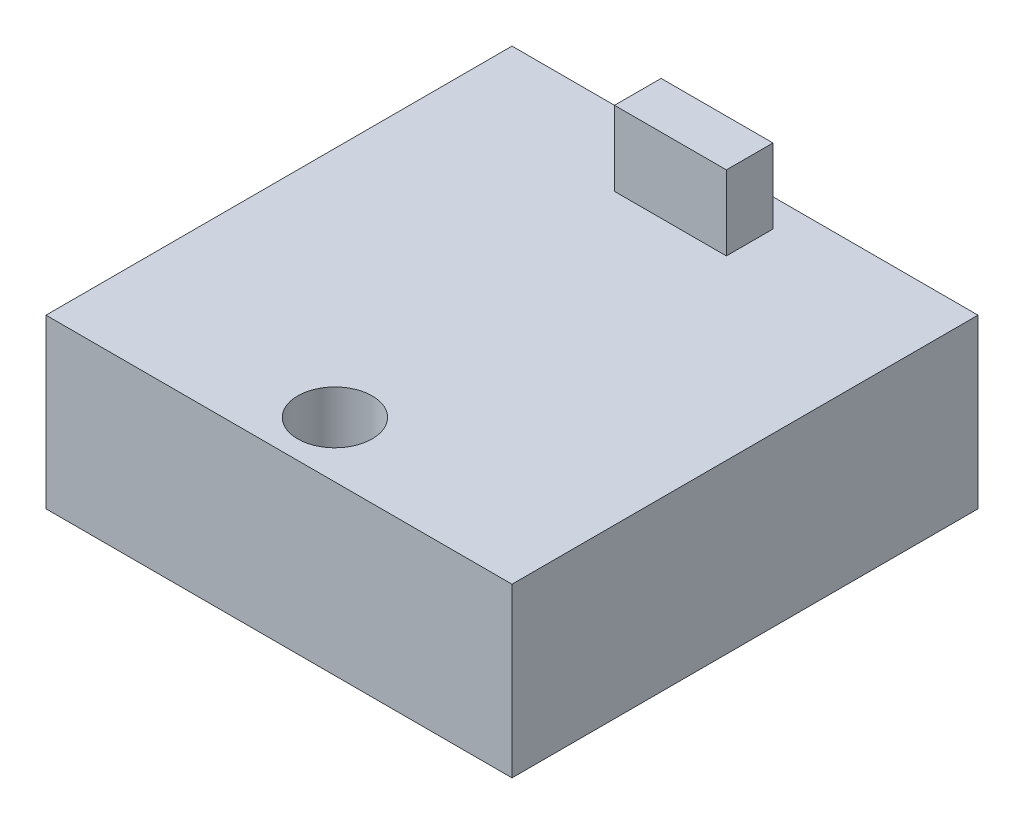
from build123d import *

# Parameters (mm, degrees)
SKETCH1_W  = 50
SKETCH1_H  = 50
BASE_DEPTH = 18
SKETCH2_R  = 4
HOLE_DEPTH = 8
SKETCH3_W  = 12
SKETCH3_H  = 5
BOSS_DEPTH = 8


with BuildPart() as part:
    # Sketch1 → Base (new body)
    with BuildSketch(Plane(origin=(0, 0, 0), x_dir=(1, 0, 0), z_dir=(0, 1, 0))):
        with Locations((25, 25)):
            Rectangle(SKETCH1_W, SKETCH1_H)
    extrude(amount=BASE_DEPTH)

    # Sketch2 → Hole (cut)
    with BuildSketch(Plane(origin=(0, 18, 0), x_dir=(-1, 0, 0), z_dir=(0, 1, 0))):
        with Locations(Location((-25, -6, 0), (0, 0, 90))):
            Circle(SKETCH2_R)
    extrude(amount=-HOLE_DEPTH, mode=Mode.SUBTRACT)

    # Sketch3 → Boss (add)
    with BuildSketch(Plane(origin=(0, 18, 0), x_dir=(-1, 0, 0), z_dir=(0, 1, 0))):
        with Locations((-25, -44.5)):
            Rectangle(SKETCH3_W, SKETCH3_H)
    extrude(amount=BOSS_DEPTH)


solid = part.part
